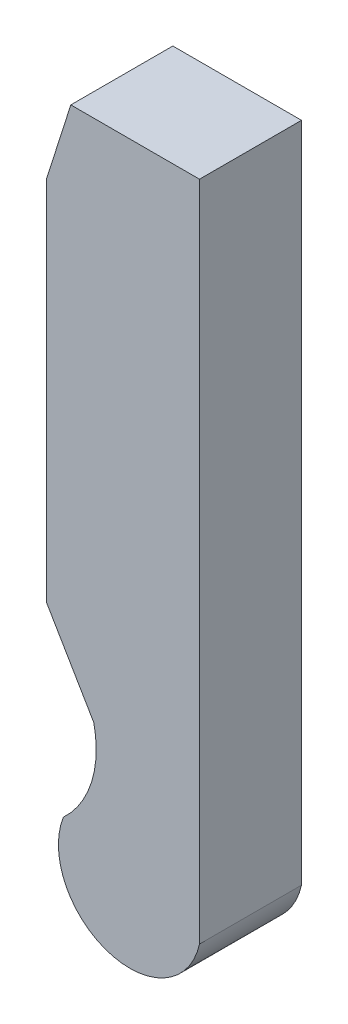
from build123d import *

# Parameters (mm, degrees)
BOSS_EXTRUDE_LEVER_DEPTH = 2.54


with BuildPart() as part:
    # Sketch Lever → Boss-Extrude Lever (new body)
    with BuildSketch(Plane.XY):
        with BuildLine():
            Line((5.966256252, 1.524562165), (5.966256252, 18.019390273))
            Line((5.966256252, 18.019390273), (2.761807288, 18.019390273))
            Line((2.761807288, 18.019390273), (2.156256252, 16.120421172))
            Line((2.156256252, 16.120421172), (2.156256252, 6.987265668))
            Line((2.156256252, 6.987265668), (3.334063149, 4.984993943))
            ThreePointArc((3.334063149, 4.984993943), (3.278869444, 3.676304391), (2.578956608, 2.569129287))
            ThreePointArc((2.578956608, 2.569129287), (3.70692735, 0.212473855), (5.966256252, 1.524562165))
        make_face()
    extrude(amount=BOSS_EXTRUDE_LEVER_DEPTH)


solid = part.part
